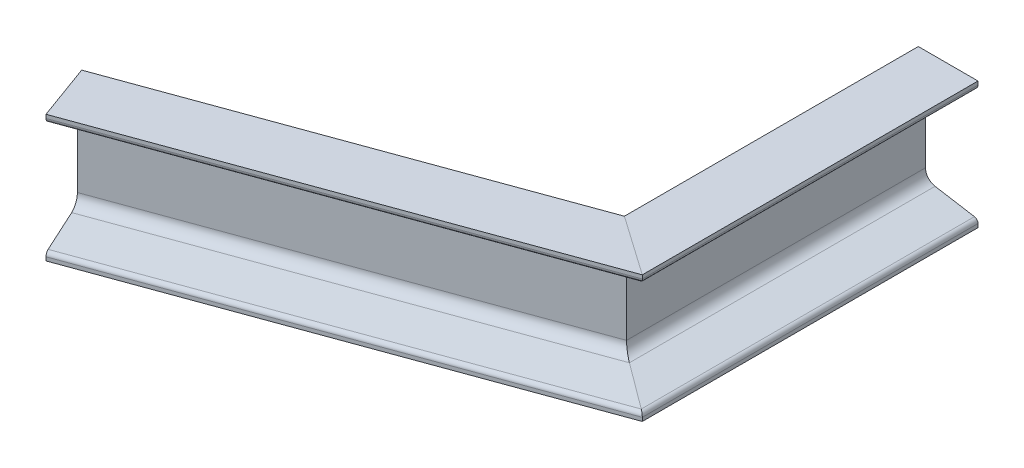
ISO-10303-21;
HEADER;
FILE_DESCRIPTION(('STEP AP214'),'2;1');
FILE_NAME('part.step','',(''),(''),'','','');
FILE_SCHEMA(('AUTOMOTIVE_DESIGN { 1 0 10303 214 1 1 1 1 }'));
ENDSEC;
DATA;
#1=APPLICATION_CONTEXT('core data for automotive mechanical design processes');
#2=APPLICATION_PROTOCOL_DEFINITION('international standard','automotive_design',2000,#1);
#3=PRODUCT_CONTEXT('',#1,'mechanical');
#4=PRODUCT('Part','Part','',(#3));
#5=PRODUCT_RELATED_PRODUCT_CATEGORY('part','',(#4));
#6=PRODUCT_DEFINITION_FORMATION('','',#4);
#7=PRODUCT_DEFINITION_CONTEXT('part definition',#1,'design');
#8=PRODUCT_DEFINITION('design','',#6,#7);
#9=PRODUCT_DEFINITION_SHAPE('','',#8);
#10=(LENGTH_UNIT() NAMED_UNIT(*) SI_UNIT(.MILLI.,.METRE.));
#11=(NAMED_UNIT(*) PLANE_ANGLE_UNIT() SI_UNIT($,.RADIAN.));
#12=(NAMED_UNIT(*) SI_UNIT($,.STERADIAN.) SOLID_ANGLE_UNIT());
#13=UNCERTAINTY_MEASURE_WITH_UNIT(LENGTH_MEASURE(1.E-05),#10,'distance_accuracy_value','');
#14=(GEOMETRIC_REPRESENTATION_CONTEXT(3) GLOBAL_UNCERTAINTY_ASSIGNED_CONTEXT((#13)) GLOBAL_UNIT_ASSIGNED_CONTEXT((#10,
#11,#12)) REPRESENTATION_CONTEXT('',''));
#15=CARTESIAN_POINT('',(0.,0.,0.));
#16=DIRECTION('',(0.,0.,1.));
#17=DIRECTION('',(1.,0.,0.));
#18=AXIS2_PLACEMENT_3D('',#15,#16,#17);
#19=CARTESIAN_POINT('',(33.274,2.157664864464,0.));
#20=DIRECTION('',(0.,0.,1.));
#21=DIRECTION('',(1.,0.,0.));
#22=AXIS2_PLACEMENT_3D('',#19,#20,#21);
#23=PLANE('',#22);
#24=DIRECTION('',(1.,0.,0.));
#25=VECTOR('',#24,1.);
#26=CARTESIAN_POINT('',(0.,0.,0.));
#27=LINE('',#26,#25);
#28=CARTESIAN_POINT('',(0.,0.,0.));
#29=VERTEX_POINT('',#28);
#30=CARTESIAN_POINT('',(35.814,0.,0.));
#31=VERTEX_POINT('',#30);
#32=EDGE_CURVE('E141',#29,#31,#27,.T.);
#33=ORIENTED_EDGE('',*,*,#32,.F.);
#34=DIRECTION('',(0.,-1.,0.));
#35=VECTOR('',#34,1.);
#36=CARTESIAN_POINT('',(0.,0.,0.));
#37=LINE('',#36,#35);
#38=CARTESIAN_POINT('',(0.,76.2,0.));
#39=VERTEX_POINT('',#38);
#40=EDGE_CURVE('E177',#39,#29,#37,.T.);
#41=ORIENTED_EDGE('',*,*,#40,.F.);
#42=DIRECTION('',(-1.,0.,0.));
#43=VECTOR('',#42,1.);
#44=CARTESIAN_POINT('',(0.,76.2,0.));
#45=LINE('',#44,#43);
#46=CARTESIAN_POINT('',(35.814,76.2,0.));
#47=VERTEX_POINT('',#46);
#48=EDGE_CURVE('E174',#47,#39,#45,.T.);
#49=ORIENTED_EDGE('',*,*,#48,.F.);
#50=DIRECTION('',(0.,1.,0.));
#51=VECTOR('',#50,1.);
#52=CARTESIAN_POINT('',(35.814,76.2,0.));
#53=LINE('',#52,#51);
#54=CARTESIAN_POINT('',(35.814,74.042335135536,0.));
#55=VERTEX_POINT('',#54);
#56=EDGE_CURVE('E171',#55,#47,#53,.T.);
#57=ORIENTED_EDGE('',*,*,#56,.F.);
#58=CARTESIAN_POINT('',(33.274,74.042335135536,0.));
#59=DIRECTION('',(0.,0.,1.));
#60=DIRECTION('',(-1.,0.,0.));
#61=AXIS2_PLACEMENT_3D('',#58,#59,#60);
#62=CIRCLE('',#61,2.54);
#63=CARTESIAN_POINT('',(33.6916030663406,71.5368995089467,0.));
#64=VERTEX_POINT('',#63);
#65=EDGE_CURVE('E168',#64,#55,#62,.T.);
#66=ORIENTED_EDGE('',*,*,#65,.F.);
#67=DIRECTION('',(0.986391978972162,0.164410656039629,0.));
#68=VECTOR('',#67,1.);
#69=CARTESIAN_POINT('',(10.0484717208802,67.5960901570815,0.));
#70=LINE('',#69,#68);
#71=CARTESIAN_POINT('',(10.0484717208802,67.5960901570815,0.));
#72=VERTEX_POINT('',#71);
#73=EDGE_CURVE('E165',#72,#64,#70,.T.);
#74=ORIENTED_EDGE('',*,*,#73,.F.);
#75=CARTESIAN_POINT('',(11.176,60.8314139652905,0.));
#76=DIRECTION('',(0.,0.,-1.));
#77=DIRECTION('',(-1.,0.,0.));
#78=AXIS2_PLACEMENT_3D('',#75,#76,#77);
#79=CIRCLE('',#78,6.858);
#80=CARTESIAN_POINT('',(4.318,60.8314139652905,0.));
#81=VERTEX_POINT('',#80);
#82=EDGE_CURVE('E162',#81,#72,#79,.T.);
#83=ORIENTED_EDGE('',*,*,#82,.F.);
#84=DIRECTION('',(0.,1.,0.));
#85=VECTOR('',#84,1.);
#86=CARTESIAN_POINT('',(4.318,60.8314139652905,0.));
#87=LINE('',#86,#85);
#88=CARTESIAN_POINT('',(4.318,15.3685860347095,0.));
#89=VERTEX_POINT('',#88);
#90=EDGE_CURVE('E159',#89,#81,#87,.T.);
#91=ORIENTED_EDGE('',*,*,#90,.F.);
#92=CARTESIAN_POINT('',(11.176,15.3685860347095,0.));
#93=DIRECTION('',(0.,0.,-1.));
#94=DIRECTION('',(1.,0.,0.));
#95=AXIS2_PLACEMENT_3D('',#92,#93,#94);
#96=CIRCLE('',#95,6.858);
#97=CARTESIAN_POINT('',(10.0484717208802,8.60390984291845,0.));
#98=VERTEX_POINT('',#97);
#99=EDGE_CURVE('E156',#98,#89,#96,.T.);
#100=ORIENTED_EDGE('',*,*,#99,.F.);
#101=DIRECTION('',(-0.986391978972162,0.16441065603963,0.));
#102=VECTOR('',#101,1.);
#103=CARTESIAN_POINT('',(10.0484717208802,8.60390984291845,0.));
#104=LINE('',#103,#102);
#105=CARTESIAN_POINT('',(33.6916030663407,4.66310049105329,0.));
#106=VERTEX_POINT('',#105);
#107=EDGE_CURVE('E153',#106,#98,#104,.T.);
#108=ORIENTED_EDGE('',*,*,#107,.F.);
#109=CARTESIAN_POINT('',(33.274,2.157664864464,0.));
#110=DIRECTION('',(0.,0.,1.));
#111=DIRECTION('',(1.,0.,0.));
#112=AXIS2_PLACEMENT_3D('',#109,#110,#111);
#113=CIRCLE('',#112,2.54);
#114=CARTESIAN_POINT('',(35.814,2.157664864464,0.));
#115=VERTEX_POINT('',#114);
#116=EDGE_CURVE('E144',#115,#106,#113,.T.);
#117=ORIENTED_EDGE('',*,*,#116,.F.);
#118=DIRECTION('',(0.,1.,0.));
#119=VECTOR('',#118,1.);
#120=CARTESIAN_POINT('',(35.814,0.,0.));
#121=LINE('',#120,#119);
#122=EDGE_CURVE('E133',#31,#115,#121,.T.);
#123=ORIENTED_EDGE('',*,*,#122,.F.);
#124=EDGE_LOOP('',(#33,#41,#49,#57,#66,#74,#83,#91,#100,#108,#117,#123));
#125=FACE_BOUND('',#124,.T.);
#126=ADVANCED_FACE('F38',(#125),#23,.F.);
#127=CARTESIAN_POINT('',(0.,0.,282.32541166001));
#128=DIRECTION('',(1.,0.,0.));
#129=DIRECTION('',(0.,1.,0.));
#130=AXIS2_PLACEMENT_3D('',#127,#128,#129);
#131=PLANE('',#130);
#132=DIRECTION('',(0.,0.,-1.));
#133=VECTOR('',#132,1.);
#134=CARTESIAN_POINT('',(0.,0.,282.32541166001));
#135=LINE('',#134,#133);
#136=CARTESIAN_POINT('',(0.,0.,176.29586054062));
#137=VERTEX_POINT('',#136);
#138=EDGE_CURVE('E147',#137,#29,#135,.T.);
#139=ORIENTED_EDGE('',*,*,#138,.F.);
#140=DIRECTION('',(0.,1.,0.));
#141=VECTOR('',#140,1.);
#142=CARTESIAN_POINT('',(0.,0.,176.29586054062));
#143=LINE('',#142,#141);
#144=CARTESIAN_POINT('',(0.,76.2,176.29586054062));
#145=VERTEX_POINT('',#144);
#146=EDGE_CURVE('E42',#137,#145,#143,.T.);
#147=ORIENTED_EDGE('',*,*,#146,.T.);
#148=DIRECTION('',(0.,0.,-1.));
#149=VECTOR('',#148,1.);
#150=CARTESIAN_POINT('',(0.,76.2,282.32541166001));
#151=LINE('',#150,#149);
#152=EDGE_CURVE('E180',#145,#39,#151,.T.);
#153=ORIENTED_EDGE('',*,*,#152,.T.);
#154=ORIENTED_EDGE('',*,*,#40,.T.);
#155=EDGE_LOOP('',(#139,#147,#153,#154));
#156=FACE_BOUND('',#155,.T.);
#157=ADVANCED_FACE('F227',(#156),#131,.F.);
#158=CARTESIAN_POINT('',(0.,76.2,282.32541166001));
#159=DIRECTION('',(0.,-1.,0.));
#160=DIRECTION('',(0.,0.,-1.));
#161=AXIS2_PLACEMENT_3D('',#158,#159,#160);
#162=PLANE('',#161);
#163=ORIENTED_EDGE('',*,*,#152,.F.);
#164=DIRECTION('',(0.819152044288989,0.,0.57357643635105));
#165=VECTOR('',#164,1.);
#166=CARTESIAN_POINT('',(49.8175933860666,76.2,211.17851496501));
#167=LINE('',#166,#165);
#168=CARTESIAN_POINT('',(35.814,76.2,201.373093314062));
#169=VERTEX_POINT('',#168);
#170=EDGE_CURVE('E221',#145,#169,#167,.T.);
#171=ORIENTED_EDGE('',*,*,#170,.T.);
#172=DIRECTION('',(0.,0.,-1.));
#173=VECTOR('',#172,1.);
#174=CARTESIAN_POINT('',(35.814,76.2,282.32541166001));
#175=LINE('',#174,#173);
#176=EDGE_CURVE('E182',#169,#47,#175,.T.);
#177=ORIENTED_EDGE('',*,*,#176,.T.);
#178=ORIENTED_EDGE('',*,*,#48,.T.);
#179=EDGE_LOOP('',(#163,#171,#177,#178));
#180=FACE_BOUND('',#179,.T.);
#181=ADVANCED_FACE('F229',(#180),#162,.F.);
#182=CARTESIAN_POINT('',(35.814,76.2,282.32541166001));
#183=DIRECTION('',(-1.,0.,0.));
#184=DIRECTION('',(0.,0.,1.));
#185=AXIS2_PLACEMENT_3D('',#182,#183,#184);
#186=PLANE('',#185);
#187=ORIENTED_EDGE('',*,*,#176,.F.);
#188=DIRECTION('',(0.,-1.,0.));
#189=VECTOR('',#188,1.);
#190=CARTESIAN_POINT('',(35.814,76.2,201.373093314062));
#191=LINE('',#190,#189);
#192=CARTESIAN_POINT('',(35.814,74.042335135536,201.373093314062));
#193=VERTEX_POINT('',#192);
#194=EDGE_CURVE('E57',#169,#193,#191,.T.);
#195=ORIENTED_EDGE('',*,*,#194,.T.);
#196=DIRECTION('',(0.,0.,-1.));
#197=VECTOR('',#196,1.);
#198=CARTESIAN_POINT('',(35.814,74.042335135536,282.32541166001));
#199=LINE('',#198,#197);
#200=EDGE_CURVE('E184',#193,#55,#199,.T.);
#201=ORIENTED_EDGE('',*,*,#200,.T.);
#202=ORIENTED_EDGE('',*,*,#56,.T.);
#203=EDGE_LOOP('',(#187,#195,#201,#202));
#204=FACE_BOUND('',#203,.T.);
#205=ADVANCED_FACE('F235',(#204),#186,.F.);
#206=CARTESIAN_POINT('',(33.274,74.042335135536,282.32541166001));
#207=DIRECTION('',(0.,0.,-1.));
#208=DIRECTION('',(-1.,0.,0.));
#209=AXIS2_PLACEMENT_3D('',#206,#207,#208);
#210=CYLINDRICAL_SURFACE('',#209,2.54);
#211=ORIENTED_EDGE('',*,*,#200,.F.);
#212=CARTESIAN_POINT('',(33.274,74.042335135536,199.59456616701));
#213=DIRECTION('',(0.57357643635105,0.,-0.819152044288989));
#214=DIRECTION('',(-0.819152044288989,0.,-0.57357643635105));
#215=AXIS2_PLACEMENT_3D('',#212,#213,#214);
#216=ELLIPSE('',#215,3.10076745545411,2.54);
#217=CARTESIAN_POINT('',(33.6916030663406,71.5368995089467,199.886974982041));
#218=VERTEX_POINT('',#217);
#219=EDGE_CURVE('E217',#193,#218,#216,.T.);
#220=ORIENTED_EDGE('',*,*,#219,.T.);
#221=DIRECTION('',(0.,0.,-1.));
#222=VECTOR('',#221,1.);
#223=CARTESIAN_POINT('',(33.6916030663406,71.5368995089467,282.32541166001));
#224=LINE('',#223,#222);
#225=EDGE_CURVE('E186',#218,#64,#224,.T.);
#226=ORIENTED_EDGE('',*,*,#225,.T.);
#227=ORIENTED_EDGE('',*,*,#65,.T.);
#228=EDGE_LOOP('',(#211,#220,#226,#227));
#229=FACE_BOUND('',#228,.T.);
#230=ADVANCED_FACE('F238',(#229),#210,.T.);
#231=CARTESIAN_POINT('',(10.0484717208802,67.5960901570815,282.32541166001));
#232=DIRECTION('',(-0.164410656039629,0.986391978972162,0.));
#233=DIRECTION('',(-0.986391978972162,-0.164410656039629,0.));
#234=AXIS2_PLACEMENT_3D('',#231,#232,#233);
#235=PLANE('',#234);
#236=ORIENTED_EDGE('',*,*,#225,.F.);
#237=DIRECTION('',(-0.811621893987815,-0.135280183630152,-0.568303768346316));
#238=VECTOR('',#237,1.);
#239=CARTESIAN_POINT('',(55.7090202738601,75.206736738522,215.303736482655));
#240=LINE('',#239,#238);
#241=CARTESIAN_POINT('',(10.0484717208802,67.5960901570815,183.331876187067));
#242=VERTEX_POINT('',#241);
#243=EDGE_CURVE('E214',#218,#242,#240,.T.);
#244=ORIENTED_EDGE('',*,*,#243,.T.);
#245=DIRECTION('',(0.,0.,-1.));
#246=VECTOR('',#245,1.);
#247=CARTESIAN_POINT('',(10.0484717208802,67.5960901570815,282.32541166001));
#248=LINE('',#247,#246);
#249=EDGE_CURVE('E188',#242,#72,#248,.T.);
#250=ORIENTED_EDGE('',*,*,#249,.T.);
#251=ORIENTED_EDGE('',*,*,#73,.T.);
#252=EDGE_LOOP('',(#236,#244,#250,#251));
#253=FACE_BOUND('',#252,.T.);
#254=ADVANCED_FACE('F241',(#253),#235,.F.);
#255=CARTESIAN_POINT('',(11.176,60.8314139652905,282.32541166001));
#256=DIRECTION('',(0.,0.,-1.));
#257=DIRECTION('',(-1.,0.,0.));
#258=AXIS2_PLACEMENT_3D('',#255,#256,#257);
#259=CYLINDRICAL_SURFACE('',#258,6.858);
#260=ORIENTED_EDGE('',*,*,#249,.F.);
#261=CARTESIAN_POINT('',(11.176,60.8314139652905,184.121379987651));
#262=DIRECTION('',(0.57357643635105,0.,-0.819152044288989));
#263=DIRECTION('',(-0.819152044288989,0.,-0.57357643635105));
#264=AXIS2_PLACEMENT_3D('',#261,#262,#263);
#265=ELLIPSE('',#264,8.37207212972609,6.858);
#266=CARTESIAN_POINT('',(4.318,60.8314139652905,179.319356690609));
#267=VERTEX_POINT('',#266);
#268=EDGE_CURVE('E211',#242,#267,#265,.F.);
#269=ORIENTED_EDGE('',*,*,#268,.T.);
#270=DIRECTION('',(0.,0.,-1.));
#271=VECTOR('',#270,1.);
#272=CARTESIAN_POINT('',(4.318,60.8314139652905,282.32541166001));
#273=LINE('',#272,#271);
#274=EDGE_CURVE('E190',#267,#81,#273,.T.);
#275=ORIENTED_EDGE('',*,*,#274,.T.);
#276=ORIENTED_EDGE('',*,*,#82,.T.);
#277=EDGE_LOOP('',(#260,#269,#275,#276));
#278=FACE_BOUND('',#277,.T.);
#279=ADVANCED_FACE('F247',(#278),#259,.F.);
#280=CARTESIAN_POINT('',(4.318,60.8314139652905,282.32541166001));
#281=DIRECTION('',(-1.,0.,0.));
#282=DIRECTION('',(0.,-1.,0.));
#283=AXIS2_PLACEMENT_3D('',#280,#281,#282);
#284=PLANE('',#283);
#285=ORIENTED_EDGE('',*,*,#274,.F.);
#286=DIRECTION('',(0.,-1.,0.));
#287=VECTOR('',#286,1.);
#288=CARTESIAN_POINT('',(4.318,60.8314139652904,179.319356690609));
#289=LINE('',#288,#287);
#290=CARTESIAN_POINT('',(4.318,15.3685860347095,179.319356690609));
#291=VERTEX_POINT('',#290);
#292=EDGE_CURVE('E208',#267,#291,#289,.T.);
#293=ORIENTED_EDGE('',*,*,#292,.T.);
#294=DIRECTION('',(0.,0.,-1.));
#295=VECTOR('',#294,1.);
#296=CARTESIAN_POINT('',(4.318,15.3685860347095,282.32541166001));
#297=LINE('',#296,#295);
#298=EDGE_CURVE('E192',#291,#89,#297,.T.);
#299=ORIENTED_EDGE('',*,*,#298,.T.);
#300=ORIENTED_EDGE('',*,*,#90,.T.);
#301=EDGE_LOOP('',(#285,#293,#299,#300));
#302=FACE_BOUND('',#301,.T.);
#303=ADVANCED_FACE('F250',(#302),#284,.F.);
#304=CARTESIAN_POINT('',(11.176,15.3685860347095,282.32541166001));
#305=DIRECTION('',(0.,0.,-1.));
#306=DIRECTION('',(-1.,0.,0.));
#307=AXIS2_PLACEMENT_3D('',#304,#305,#306);
#308=CYLINDRICAL_SURFACE('',#307,6.858);
#309=ORIENTED_EDGE('',*,*,#298,.F.);
#310=CARTESIAN_POINT('',(11.176,15.3685860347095,184.121379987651));
#311=DIRECTION('',(0.57357643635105,0.,-0.819152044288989));
#312=DIRECTION('',(-0.819152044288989,0.,-0.57357643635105));
#313=AXIS2_PLACEMENT_3D('',#310,#311,#312);
#314=ELLIPSE('',#313,8.3720721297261,6.858);
#315=CARTESIAN_POINT('',(10.0484717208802,8.60390984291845,183.331876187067));
#316=VERTEX_POINT('',#315);
#317=EDGE_CURVE('E203',#291,#316,#314,.F.);
#318=ORIENTED_EDGE('',*,*,#317,.T.);
#319=DIRECTION('',(0.,0.,-1.));
#320=VECTOR('',#319,1.);
#321=CARTESIAN_POINT('',(10.0484717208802,8.60390984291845,282.32541166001));
#322=LINE('',#321,#320);
#323=EDGE_CURVE('E194',#316,#98,#322,.T.);
#324=ORIENTED_EDGE('',*,*,#323,.T.);
#325=ORIENTED_EDGE('',*,*,#99,.T.);
#326=EDGE_LOOP('',(#309,#318,#324,#325));
#327=FACE_BOUND('',#326,.T.);
#328=ADVANCED_FACE('F253',(#327),#308,.F.);
#329=CARTESIAN_POINT('',(10.0484717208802,8.60390984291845,282.32541166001));
#330=DIRECTION('',(-0.16441065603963,-0.986391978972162,0.));
#331=DIRECTION('',(0.986391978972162,-0.16441065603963,0.));
#332=AXIS2_PLACEMENT_3D('',#329,#330,#331);
#333=PLANE('',#332);
#334=ORIENTED_EDGE('',*,*,#323,.F.);
#335=DIRECTION('',(0.811621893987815,-0.135280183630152,0.568303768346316));
#336=VECTOR('',#335,1.);
#337=CARTESIAN_POINT('',(55.7090202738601,0.993263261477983,215.303736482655));
#338=LINE('',#337,#336);
#339=CARTESIAN_POINT('',(33.6916030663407,4.66310049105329,199.886974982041));
#340=VERTEX_POINT('',#339);
#341=EDGE_CURVE('E201',#316,#340,#338,.T.);
#342=ORIENTED_EDGE('',*,*,#341,.T.);
#343=DIRECTION('',(0.,0.,-1.));
#344=VECTOR('',#343,1.);
#345=CARTESIAN_POINT('',(33.6916030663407,4.66310049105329,282.32541166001));
#346=LINE('',#345,#344);
#347=EDGE_CURVE('E196',#340,#106,#346,.T.);
#348=ORIENTED_EDGE('',*,*,#347,.T.);
#349=ORIENTED_EDGE('',*,*,#107,.T.);
#350=EDGE_LOOP('',(#334,#342,#348,#349));
#351=FACE_BOUND('',#350,.T.);
#352=ADVANCED_FACE('F256',(#351),#333,.F.);
#353=CARTESIAN_POINT('',(33.274,2.157664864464,282.32541166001));
#354=DIRECTION('',(0.,0.,-1.));
#355=DIRECTION('',(-1.,0.,0.));
#356=AXIS2_PLACEMENT_3D('',#353,#354,#355);
#357=CYLINDRICAL_SURFACE('',#356,2.54);
#358=ORIENTED_EDGE('',*,*,#347,.F.);
#359=CARTESIAN_POINT('',(33.274,2.157664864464,199.59456616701));
#360=DIRECTION('',(0.57357643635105,0.,-0.819152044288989));
#361=DIRECTION('',(-0.819152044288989,0.,-0.57357643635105));
#362=AXIS2_PLACEMENT_3D('',#359,#360,#361);
#363=ELLIPSE('',#362,3.10076745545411,2.54);
#364=CARTESIAN_POINT('',(35.814,2.157664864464,201.373093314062));
#365=VERTEX_POINT('',#364);
#366=EDGE_CURVE('E82',#340,#365,#363,.T.);
#367=ORIENTED_EDGE('',*,*,#366,.T.);
#368=DIRECTION('',(0.,0.,-1.));
#369=VECTOR('',#368,1.);
#370=CARTESIAN_POINT('',(35.814,2.157664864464,282.32541166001));
#371=LINE('',#370,#369);
#372=EDGE_CURVE('E137',#365,#115,#371,.T.);
#373=ORIENTED_EDGE('',*,*,#372,.T.);
#374=ORIENTED_EDGE('',*,*,#116,.T.);
#375=EDGE_LOOP('',(#358,#367,#373,#374));
#376=FACE_BOUND('',#375,.T.);
#377=ADVANCED_FACE('F199',(#376),#357,.T.);
#378=CARTESIAN_POINT('',(35.814,0.,282.32541166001));
#379=DIRECTION('',(-1.,0.,0.));
#380=DIRECTION('',(0.,0.,1.));
#381=AXIS2_PLACEMENT_3D('',#378,#379,#380);
#382=PLANE('',#381);
#383=ORIENTED_EDGE('',*,*,#372,.F.);
#384=DIRECTION('',(0.,-1.,0.));
#385=VECTOR('',#384,1.);
#386=CARTESIAN_POINT('',(35.814,0.,201.373093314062));
#387=LINE('',#386,#385);
#388=CARTESIAN_POINT('',(35.814,0.,201.373093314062));
#389=VERTEX_POINT('',#388);
#390=EDGE_CURVE('E48',#365,#389,#387,.T.);
#391=ORIENTED_EDGE('',*,*,#390,.T.);
#392=DIRECTION('',(0.,0.,-1.));
#393=VECTOR('',#392,1.);
#394=CARTESIAN_POINT('',(35.814,0.,282.32541166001));
#395=LINE('',#394,#393);
#396=EDGE_CURVE('E130',#389,#31,#395,.T.);
#397=ORIENTED_EDGE('',*,*,#396,.T.);
#398=ORIENTED_EDGE('',*,*,#122,.T.);
#399=EDGE_LOOP('',(#383,#391,#397,#398));
#400=FACE_BOUND('',#399,.T.);
#401=ADVANCED_FACE('F132',(#400),#382,.F.);
#402=CARTESIAN_POINT('',(0.,0.,282.32541166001));
#403=DIRECTION('',(0.,1.,0.));
#404=DIRECTION('',(0.,0.,1.));
#405=AXIS2_PLACEMENT_3D('',#402,#403,#404);
#406=PLANE('',#405);
#407=ORIENTED_EDGE('',*,*,#396,.F.);
#408=DIRECTION('',(-0.819152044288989,0.,-0.57357643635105));
#409=VECTOR('',#408,1.);
#410=CARTESIAN_POINT('',(49.8175933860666,0.,211.17851496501));
#411=LINE('',#410,#409);
#412=EDGE_CURVE('E12',#389,#137,#411,.T.);
#413=ORIENTED_EDGE('',*,*,#412,.T.);
#414=ORIENTED_EDGE('',*,*,#138,.T.);
#415=ORIENTED_EDGE('',*,*,#32,.T.);
#416=EDGE_LOOP('',(#407,#413,#414,#415));
#417=FACE_BOUND('',#416,.T.);
#418=ADVANCED_FACE('F40',(#417),#406,.F.);
#419=CARTESIAN_POINT('',(-82.8319596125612,0.,118.296298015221));
#420=DIRECTION('',(0.57357643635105,0.,-0.819152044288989));
#421=DIRECTION('',(-0.819152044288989,0.,-0.57357643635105));
#422=AXIS2_PLACEMENT_3D('',#419,#420,#421);
#423=PLANE('',#422);
#424=ORIENTED_EDGE('',*,*,#390,.F.);
#425=ORIENTED_EDGE('',*,*,#366,.F.);
#426=ORIENTED_EDGE('',*,*,#341,.F.);
#427=ORIENTED_EDGE('',*,*,#317,.F.);
#428=ORIENTED_EDGE('',*,*,#292,.F.);
#429=ORIENTED_EDGE('',*,*,#268,.F.);
#430=ORIENTED_EDGE('',*,*,#243,.F.);
#431=ORIENTED_EDGE('',*,*,#219,.F.);
#432=ORIENTED_EDGE('',*,*,#194,.F.);
#433=ORIENTED_EDGE('',*,*,#170,.F.);
#434=ORIENTED_EDGE('',*,*,#146,.F.);
#435=ORIENTED_EDGE('',*,*,#412,.F.);
#436=EDGE_LOOP('',(#424,#425,#426,#427,#428,#429,#430,#431,#432,#433,#434,#435));
#437=FACE_BOUND('',#436,.T.);
#438=ADVANCED_FACE('F228',(#437),#423,.F.);
#439=CLOSED_SHELL('',(#126,#157,#181,#205,#230,#254,#279,#303,#328,#352,#377,#401,#418,#438));
#440=MANIFOLD_SOLID_BREP('B2',#439);
#441=CARTESIAN_POINT('',(-82.8319596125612,0.,118.296298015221));
#442=DIRECTION('',(0.57357643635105,0.,-0.819152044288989));
#443=DIRECTION('',(-0.819152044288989,0.,-0.57357643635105));
#444=AXIS2_PLACEMENT_3D('',#441,#442,#443);
#445=PLANE('',#444);
#446=DIRECTION('',(0.819152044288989,0.,0.57357643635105));
#447=VECTOR('',#446,1.);
#448=CARTESIAN_POINT('',(49.817593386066,0.,211.17851496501));
#449=LINE('',#448,#447);
#450=CARTESIAN_POINT('',(0.,0.,176.29586054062));
#451=VERTEX_POINT('',#450);
#452=CARTESIAN_POINT('',(35.8139999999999,0.,201.373093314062));
#453=VERTEX_POINT('',#452);
#454=EDGE_CURVE('E349',#451,#453,#449,.T.);
#455=ORIENTED_EDGE('',*,*,#454,.F.);
#456=DIRECTION('',(0.,-1.,0.));
#457=VECTOR('',#456,1.);
#458=CARTESIAN_POINT('',(0.,0.,176.29586054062));
#459=LINE('',#458,#457);
#460=CARTESIAN_POINT('',(0.,76.2,176.29586054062));
#461=VERTEX_POINT('',#460);
#462=EDGE_CURVE('E459',#461,#451,#459,.T.);
#463=ORIENTED_EDGE('',*,*,#462,.F.);
#464=DIRECTION('',(-0.819152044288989,0.,-0.57357643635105));
#465=VECTOR('',#464,1.);
#466=CARTESIAN_POINT('',(49.817593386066,76.2,211.17851496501));
#467=LINE('',#466,#465);
#468=CARTESIAN_POINT('',(35.8139999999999,76.2,201.373093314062));
#469=VERTEX_POINT('',#468);
#470=EDGE_CURVE('E463',#469,#461,#467,.T.);
#471=ORIENTED_EDGE('',*,*,#470,.F.);
#472=DIRECTION('',(0.,1.,0.));
#473=VECTOR('',#472,1.);
#474=CARTESIAN_POINT('',(35.8139999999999,76.2,201.373093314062));
#475=LINE('',#474,#473);
#476=CARTESIAN_POINT('',(35.8139999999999,74.042335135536,201.373093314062));
#477=VERTEX_POINT('',#476);
#478=EDGE_CURVE('E467',#477,#469,#475,.T.);
#479=ORIENTED_EDGE('',*,*,#478,.F.);
#480=CARTESIAN_POINT('',(33.2739999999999,74.042335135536,199.59456616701));
#481=DIRECTION('',(0.57357643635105,0.,-0.819152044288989));
#482=DIRECTION('',(-0.819152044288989,0.,-0.57357643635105));
#483=AXIS2_PLACEMENT_3D('',#480,#481,#482);
#484=ELLIPSE('',#483,3.10076745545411,2.54000000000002);
#485=CARTESIAN_POINT('',(33.6916030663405,71.5368995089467,199.886974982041));
#486=VERTEX_POINT('',#485);
#487=EDGE_CURVE('E471',#486,#477,#484,.F.);
#488=ORIENTED_EDGE('',*,*,#487,.F.);
#489=DIRECTION('',(0.811621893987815,0.135280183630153,0.568303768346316));
#490=VECTOR('',#489,1.);
#491=CARTESIAN_POINT('',(55.7090202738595,75.2067367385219,215.303736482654));
#492=LINE('',#491,#490);
#493=CARTESIAN_POINT('',(10.0484717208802,67.5960901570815,183.331876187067));
#494=VERTEX_POINT('',#493);
#495=EDGE_CURVE('E475',#494,#486,#492,.T.);
#496=ORIENTED_EDGE('',*,*,#495,.F.);
#497=CARTESIAN_POINT('',(11.176,60.8314139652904,184.121379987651));
#498=DIRECTION('',(0.57357643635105,0.,-0.819152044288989));
#499=DIRECTION('',(-0.819152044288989,0.,-0.57357643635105));
#500=AXIS2_PLACEMENT_3D('',#497,#498,#499);
#501=ELLIPSE('',#500,8.37207212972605,6.858);
#502=CARTESIAN_POINT('',(4.31800000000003,60.8314139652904,179.319356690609));
#503=VERTEX_POINT('',#502);
#504=EDGE_CURVE('E479',#503,#494,#501,.T.);
#505=ORIENTED_EDGE('',*,*,#504,.F.);
#506=DIRECTION('',(0.,1.,0.));
#507=VECTOR('',#506,1.);
#508=CARTESIAN_POINT('',(4.31800000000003,60.8314139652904,179.319356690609));
#509=LINE('',#508,#507);
#510=CARTESIAN_POINT('',(4.31800000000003,15.3685860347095,179.319356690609));
#511=VERTEX_POINT('',#510);
#512=EDGE_CURVE('E483',#511,#503,#509,.T.);
#513=ORIENTED_EDGE('',*,*,#512,.F.);
#514=CARTESIAN_POINT('',(11.176,15.3685860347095,184.121379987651));
#515=DIRECTION('',(0.57357643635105,0.,-0.819152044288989));
#516=DIRECTION('',(-0.819152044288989,0.,-0.57357643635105));
#517=AXIS2_PLACEMENT_3D('',#514,#515,#516);
#518=ELLIPSE('',#517,8.37207212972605,6.858);
#519=CARTESIAN_POINT('',(10.0484717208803,8.60390984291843,183.331876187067));
#520=VERTEX_POINT('',#519);
#521=EDGE_CURVE('E487',#520,#511,#518,.T.);
#522=ORIENTED_EDGE('',*,*,#521,.F.);
#523=DIRECTION('',(-0.811621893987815,0.135280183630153,-0.568303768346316));
#524=VECTOR('',#523,1.);
#525=CARTESIAN_POINT('',(55.7090202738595,0.993263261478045,215.303736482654));
#526=LINE('',#525,#524);
#527=CARTESIAN_POINT('',(33.6916030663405,4.66310049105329,199.886974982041));
#528=VERTEX_POINT('',#527);
#529=EDGE_CURVE('E396',#528,#520,#526,.T.);
#530=ORIENTED_EDGE('',*,*,#529,.F.);
#531=CARTESIAN_POINT('',(33.2739999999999,2.157664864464,199.59456616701));
#532=DIRECTION('',(0.57357643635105,0.,-0.819152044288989));
#533=DIRECTION('',(-0.819152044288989,0.,-0.57357643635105));
#534=AXIS2_PLACEMENT_3D('',#531,#532,#533);
#535=ELLIPSE('',#534,3.10076745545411,2.54000000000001);
#536=CARTESIAN_POINT('',(35.8139999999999,2.15766486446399,201.373093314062));
#537=VERTEX_POINT('',#536);
#538=EDGE_CURVE('E401',#537,#528,#535,.F.);
#539=ORIENTED_EDGE('',*,*,#538,.F.);
#540=DIRECTION('',(0.,1.,0.));
#541=VECTOR('',#540,1.);
#542=CARTESIAN_POINT('',(35.8139999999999,0.,201.373093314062));
#543=LINE('',#542,#541);
#544=EDGE_CURVE('E440',#453,#537,#543,.T.);
#545=ORIENTED_EDGE('',*,*,#544,.F.);
#546=EDGE_LOOP('',(#455,#463,#471,#479,#488,#496,#505,#513,#522,#530,#539,#545));
#547=FACE_BOUND('',#546,.T.);
#548=ADVANCED_FACE('F341',(#547),#445,.T.);
#549=CARTESIAN_POINT('',(-227.301547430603,2.157664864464,294.436309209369));
#550=DIRECTION('',(-0.939692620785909,0.,0.342020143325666));
#551=DIRECTION('',(0.342020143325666,0.,0.939692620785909));
#552=AXIS2_PLACEMENT_3D('',#549,#550,#551);
#553=PLANE('',#552);
#554=DIRECTION('',(0.342020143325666,0.,0.939692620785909));
#555=VECTOR('',#554,1.);
#556=CARTESIAN_POINT('',(-238.681925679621,0.,263.168976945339));
#557=LINE('',#556,#555);
#558=CARTESIAN_POINT('',(-238.681925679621,0.,263.168976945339));
#559=VERTEX_POINT('',#558);
#560=CARTESIAN_POINT('',(-226.432816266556,0.,296.823128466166));
#561=VERTEX_POINT('',#560);
#562=EDGE_CURVE('E450',#559,#561,#557,.T.);
#563=ORIENTED_EDGE('',*,*,#562,.T.);
#564=DIRECTION('',(0.,1.,0.));
#565=VECTOR('',#564,1.);
#566=CARTESIAN_POINT('',(-226.432816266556,0.,296.823128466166));
#567=LINE('',#566,#565);
#568=CARTESIAN_POINT('',(-226.432816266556,2.15766486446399,296.823128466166));
#569=VERTEX_POINT('',#568);
#570=EDGE_CURVE('E438',#561,#569,#567,.T.);
#571=ORIENTED_EDGE('',*,*,#570,.T.);
#572=CARTESIAN_POINT('',(-227.301547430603,2.157664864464,294.436309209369));
#573=DIRECTION('',(-0.939692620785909,0.,0.342020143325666));
#574=DIRECTION('',(0.342020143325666,0.,0.939692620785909));
#575=AXIS2_PLACEMENT_3D('',#572,#573,#574);
#576=CIRCLE('',#575,2.54000000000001);
#577=CARTESIAN_POINT('',(-227.15871877,4.66310049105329,294.828727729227));
#578=VERTEX_POINT('',#577);
#579=EDGE_CURVE('E442',#569,#578,#576,.T.);
#580=ORIENTED_EDGE('',*,*,#579,.T.);
#581=DIRECTION('',(-0.337365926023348,0.16441065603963,-0.92690526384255));
#582=VECTOR('',#581,1.);
#583=CARTESIAN_POINT('',(-235.245145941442,8.60390984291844,272.611451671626));
#584=LINE('',#583,#582);
#585=CARTESIAN_POINT('',(-235.245145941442,8.60390984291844,272.611451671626));
#586=VERTEX_POINT('',#585);
#587=EDGE_CURVE('E446',#578,#586,#584,.T.);
#588=ORIENTED_EDGE('',*,*,#587,.T.);
#589=CARTESIAN_POINT('',(-234.859508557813,15.3685860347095,273.670981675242));
#590=DIRECTION('',(0.939692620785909,0.,-0.342020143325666));
#591=DIRECTION('',(0.342020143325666,0.,0.939692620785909));
#592=AXIS2_PLACEMENT_3D('',#589,#590,#591);
#593=CIRCLE('',#592,6.858);
#594=CARTESIAN_POINT('',(-237.205082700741,15.3685860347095,267.226569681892));
#595=VERTEX_POINT('',#594);
#596=EDGE_CURVE('E508',#586,#595,#593,.T.);
#597=ORIENTED_EDGE('',*,*,#596,.T.);
#598=DIRECTION('',(0.,1.,0.));
#599=VECTOR('',#598,1.);
#600=CARTESIAN_POINT('',(-237.205082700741,60.8314139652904,267.226569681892));
#601=LINE('',#600,#599);
#602=CARTESIAN_POINT('',(-237.205082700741,60.8314139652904,267.226569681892));
#603=VERTEX_POINT('',#602);
#604=EDGE_CURVE('E513',#595,#603,#601,.T.);
#605=ORIENTED_EDGE('',*,*,#604,.T.);
#606=CARTESIAN_POINT('',(-234.859508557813,60.8314139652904,273.670981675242));
#607=DIRECTION('',(0.939692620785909,0.,-0.342020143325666));
#608=DIRECTION('',(-0.342020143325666,0.,-0.939692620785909));
#609=AXIS2_PLACEMENT_3D('',#606,#607,#608);
#610=CIRCLE('',#609,6.858);
#611=CARTESIAN_POINT('',(-235.245145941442,67.5960901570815,272.611451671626));
#612=VERTEX_POINT('',#611);
#613=EDGE_CURVE('E517',#603,#612,#610,.T.);
#614=ORIENTED_EDGE('',*,*,#613,.T.);
#615=DIRECTION('',(0.337365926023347,0.16441065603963,0.92690526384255));
#616=VECTOR('',#615,1.);
#617=CARTESIAN_POINT('',(-235.245145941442,67.5960901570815,272.611451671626));
#618=LINE('',#617,#616);
#619=CARTESIAN_POINT('',(-227.15871877,71.5368995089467,294.828727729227));
#620=VERTEX_POINT('',#619);
#621=EDGE_CURVE('E520',#612,#620,#618,.T.);
#622=ORIENTED_EDGE('',*,*,#621,.T.);
#623=CARTESIAN_POINT('',(-227.301547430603,74.042335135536,294.436309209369));
#624=DIRECTION('',(-0.939692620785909,0.,0.342020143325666));
#625=DIRECTION('',(-0.342020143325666,0.,-0.939692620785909));
#626=AXIS2_PLACEMENT_3D('',#623,#624,#625);
#627=CIRCLE('',#626,2.54000000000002);
#628=CARTESIAN_POINT('',(-226.432816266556,74.042335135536,296.823128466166));
#629=VERTEX_POINT('',#628);
#630=EDGE_CURVE('E523',#620,#629,#627,.T.);
#631=ORIENTED_EDGE('',*,*,#630,.T.);
#632=DIRECTION('',(0.,1.,0.));
#633=VECTOR('',#632,1.);
#634=CARTESIAN_POINT('',(-226.432816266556,76.2,296.823128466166));
#635=LINE('',#634,#633);
#636=CARTESIAN_POINT('',(-226.432816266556,76.2,296.823128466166));
#637=VERTEX_POINT('',#636);
#638=EDGE_CURVE('E526',#629,#637,#635,.T.);
#639=ORIENTED_EDGE('',*,*,#638,.T.);
#640=DIRECTION('',(-0.342020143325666,0.,-0.939692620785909));
#641=VECTOR('',#640,1.);
#642=CARTESIAN_POINT('',(-238.681925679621,76.2,263.168976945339));
#643=LINE('',#642,#641);
#644=CARTESIAN_POINT('',(-238.681925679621,76.2,263.168976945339));
#645=VERTEX_POINT('',#644);
#646=EDGE_CURVE('E529',#637,#645,#643,.T.);
#647=ORIENTED_EDGE('',*,*,#646,.T.);
#648=DIRECTION('',(0.,-1.,0.));
#649=VECTOR('',#648,1.);
#650=CARTESIAN_POINT('',(-238.681925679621,0.,263.168976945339));
#651=LINE('',#650,#649);
#652=EDGE_CURVE('E456',#645,#559,#651,.T.);
#653=ORIENTED_EDGE('',*,*,#652,.T.);
#654=EDGE_LOOP('',(#563,#571,#580,#588,#597,#605,#614,#622,#631,#639,#647,#653));
#655=FACE_BOUND('',#654,.T.);
#656=ADVANCED_FACE('F448',(#655),#553,.T.);
#657=CARTESIAN_POINT('',(111.884296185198,0.,173.685769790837));
#658=DIRECTION('',(0.342020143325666,0.,0.939692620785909));
#659=DIRECTION('',(0.939692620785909,0.,-0.342020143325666));
#660=AXIS2_PLACEMENT_3D('',#657,#658,#659);
#661=PLANE('',#660);
#662=DIRECTION('',(-0.939692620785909,0.,0.342020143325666));
#663=VECTOR('',#662,1.);
#664=CARTESIAN_POINT('',(111.884296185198,0.,173.685769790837));
#665=LINE('',#664,#663);
#666=EDGE_CURVE('E36',#453,#561,#665,.T.);
#667=ORIENTED_EDGE('',*,*,#666,.F.);
#668=ORIENTED_EDGE('',*,*,#544,.T.);
#669=DIRECTION('',(-0.939692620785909,0.,0.342020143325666));
#670=VECTOR('',#669,1.);
#671=CARTESIAN_POINT('',(111.884296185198,2.15766486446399,173.685769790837));
#672=LINE('',#671,#670);
#673=EDGE_CURVE('E435',#537,#569,#672,.T.);
#674=ORIENTED_EDGE('',*,*,#673,.T.);
#675=ORIENTED_EDGE('',*,*,#570,.F.);
#676=EDGE_LOOP('',(#667,#668,#674,#675));
#677=FACE_BOUND('',#676,.T.);
#678=ADVANCED_FACE('F436',(#677),#661,.T.);
#679=CARTESIAN_POINT('',(111.015565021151,2.157664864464,171.29895053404));
#680=DIRECTION('',(-0.939692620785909,0.,0.342020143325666));
#681=DIRECTION('',(0.342020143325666,0.,0.939692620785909));
#682=AXIS2_PLACEMENT_3D('',#679,#680,#681);
#683=CYLINDRICAL_SURFACE('',#682,2.54000000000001);
#684=ORIENTED_EDGE('',*,*,#673,.F.);
#685=ORIENTED_EDGE('',*,*,#538,.T.);
#686=DIRECTION('',(-0.939692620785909,0.,0.342020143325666));
#687=VECTOR('',#686,1.);
#688=CARTESIAN_POINT('',(111.158393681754,4.66310049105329,171.691369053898));
#689=LINE('',#688,#687);
#690=EDGE_CURVE('E430',#528,#578,#689,.T.);
#691=ORIENTED_EDGE('',*,*,#690,.T.);
#692=ORIENTED_EDGE('',*,*,#579,.F.);
#693=EDGE_LOOP('',(#684,#685,#691,#692));
#694=FACE_BOUND('',#693,.T.);
#695=ADVANCED_FACE('F443',(#694),#683,.T.);
#696=CARTESIAN_POINT('',(103.071966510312,8.60390984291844,149.474092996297));
#697=DIRECTION('',(0.0562317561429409,0.986391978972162,0.15449548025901));
#698=DIRECTION('',(0.,-0.154740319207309,0.98795517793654));
#699=AXIS2_PLACEMENT_3D('',#696,#697,#698);
#700=PLANE('',#699);
#701=ORIENTED_EDGE('',*,*,#690,.F.);
#702=ORIENTED_EDGE('',*,*,#529,.T.);
#703=DIRECTION('',(-0.939692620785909,0.,0.342020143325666));
#704=VECTOR('',#703,1.);
#705=CARTESIAN_POINT('',(103.071966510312,8.60390984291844,149.474092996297));
#706=LINE('',#705,#704);
#707=EDGE_CURVE('E490',#520,#586,#706,.T.);
#708=ORIENTED_EDGE('',*,*,#707,.T.);
#709=ORIENTED_EDGE('',*,*,#587,.F.);
#710=EDGE_LOOP('',(#701,#702,#708,#709));
#711=FACE_BOUND('',#710,.T.);
#712=ADVANCED_FACE('F505',(#711),#700,.T.);
#713=CARTESIAN_POINT('',(103.45760389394,15.3685860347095,150.533622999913));
#714=DIRECTION('',(-0.939692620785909,0.,0.342020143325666));
#715=DIRECTION('',(0.342020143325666,0.,0.939692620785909));
#716=AXIS2_PLACEMENT_3D('',#713,#714,#715);
#717=CYLINDRICAL_SURFACE('',#716,6.858);
#718=ORIENTED_EDGE('',*,*,#707,.F.);
#719=ORIENTED_EDGE('',*,*,#521,.T.);
#720=DIRECTION('',(-0.939692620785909,0.,0.342020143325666));
#721=VECTOR('',#720,1.);
#722=CARTESIAN_POINT('',(101.112029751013,15.3685860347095,144.089211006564));
#723=LINE('',#722,#721);
#724=EDGE_CURVE('E486',#511,#595,#723,.T.);
#725=ORIENTED_EDGE('',*,*,#724,.T.);
#726=ORIENTED_EDGE('',*,*,#596,.F.);
#727=EDGE_LOOP('',(#718,#719,#725,#726));
#728=FACE_BOUND('',#727,.T.);
#729=ADVANCED_FACE('F509',(#728),#717,.F.);
#730=CARTESIAN_POINT('',(101.112029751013,60.8314139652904,144.089211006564));
#731=DIRECTION('',(0.342020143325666,0.,0.939692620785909));
#732=DIRECTION('',(0.939692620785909,0.,-0.342020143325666));
#733=AXIS2_PLACEMENT_3D('',#730,#731,#732);
#734=PLANE('',#733);
#735=ORIENTED_EDGE('',*,*,#724,.F.);
#736=ORIENTED_EDGE('',*,*,#512,.T.);
#737=DIRECTION('',(-0.939692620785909,0.,0.342020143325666));
#738=VECTOR('',#737,1.);
#739=CARTESIAN_POINT('',(101.112029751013,60.8314139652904,144.089211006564));
#740=LINE('',#739,#738);
#741=EDGE_CURVE('E482',#503,#603,#740,.T.);
#742=ORIENTED_EDGE('',*,*,#741,.T.);
#743=ORIENTED_EDGE('',*,*,#604,.F.);
#744=EDGE_LOOP('',(#735,#736,#742,#743));
#745=FACE_BOUND('',#744,.T.);
#746=ADVANCED_FACE('F570',(#745),#734,.T.);
#747=CARTESIAN_POINT('',(103.45760389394,60.8314139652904,150.533622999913));
#748=DIRECTION('',(-0.939692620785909,0.,0.342020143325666));
#749=DIRECTION('',(0.342020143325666,0.,0.939692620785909));
#750=AXIS2_PLACEMENT_3D('',#747,#748,#749);
#751=CYLINDRICAL_SURFACE('',#750,6.858);
#752=ORIENTED_EDGE('',*,*,#741,.F.);
#753=ORIENTED_EDGE('',*,*,#504,.T.);
#754=DIRECTION('',(-0.939692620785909,0.,0.342020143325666));
#755=VECTOR('',#754,1.);
#756=CARTESIAN_POINT('',(103.071966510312,67.5960901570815,149.474092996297));
#757=LINE('',#756,#755);
#758=EDGE_CURVE('E478',#494,#612,#757,.T.);
#759=ORIENTED_EDGE('',*,*,#758,.T.);
#760=ORIENTED_EDGE('',*,*,#613,.F.);
#761=EDGE_LOOP('',(#752,#753,#759,#760));
#762=FACE_BOUND('',#761,.T.);
#763=ADVANCED_FACE('F568',(#762),#751,.F.);
#764=CARTESIAN_POINT('',(103.071966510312,67.5960901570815,149.474092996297));
#765=DIRECTION('',(0.0562317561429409,-0.986391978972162,0.15449548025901));
#766=DIRECTION('',(0.,-0.154740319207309,-0.98795517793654));
#767=AXIS2_PLACEMENT_3D('',#764,#765,#766);
#768=PLANE('',#767);
#769=ORIENTED_EDGE('',*,*,#758,.F.);
#770=ORIENTED_EDGE('',*,*,#495,.T.);
#771=DIRECTION('',(-0.939692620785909,0.,0.342020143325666));
#772=VECTOR('',#771,1.);
#773=CARTESIAN_POINT('',(111.158393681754,71.5368995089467,171.691369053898));
#774=LINE('',#773,#772);
#775=EDGE_CURVE('E474',#486,#620,#774,.T.);
#776=ORIENTED_EDGE('',*,*,#775,.T.);
#777=ORIENTED_EDGE('',*,*,#621,.F.);
#778=EDGE_LOOP('',(#769,#770,#776,#777));
#779=FACE_BOUND('',#778,.T.);
#780=ADVANCED_FACE('F565',(#779),#768,.T.);
#781=CARTESIAN_POINT('',(111.015565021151,74.042335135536,171.29895053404));
#782=DIRECTION('',(-0.939692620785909,0.,0.342020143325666));
#783=DIRECTION('',(0.342020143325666,0.,0.939692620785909));
#784=AXIS2_PLACEMENT_3D('',#781,#782,#783);
#785=CYLINDRICAL_SURFACE('',#784,2.54000000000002);
#786=ORIENTED_EDGE('',*,*,#775,.F.);
#787=ORIENTED_EDGE('',*,*,#487,.T.);
#788=DIRECTION('',(-0.939692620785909,0.,0.342020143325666));
#789=VECTOR('',#788,1.);
#790=CARTESIAN_POINT('',(111.884296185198,74.042335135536,173.685769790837));
#791=LINE('',#790,#789);
#792=EDGE_CURVE('E470',#477,#629,#791,.T.);
#793=ORIENTED_EDGE('',*,*,#792,.T.);
#794=ORIENTED_EDGE('',*,*,#630,.F.);
#795=EDGE_LOOP('',(#786,#787,#793,#794));
#796=FACE_BOUND('',#795,.T.);
#797=ADVANCED_FACE('F560',(#796),#785,.T.);
#798=CARTESIAN_POINT('',(111.884296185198,76.2,173.685769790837));
#799=DIRECTION('',(0.342020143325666,0.,0.939692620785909));
#800=DIRECTION('',(0.939692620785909,0.,-0.342020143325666));
#801=AXIS2_PLACEMENT_3D('',#798,#799,#800);
#802=PLANE('',#801);
#803=ORIENTED_EDGE('',*,*,#792,.F.);
#804=ORIENTED_EDGE('',*,*,#478,.T.);
#805=DIRECTION('',(-0.939692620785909,0.,0.342020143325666));
#806=VECTOR('',#805,1.);
#807=CARTESIAN_POINT('',(111.884296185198,76.2,173.685769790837));
#808=LINE('',#807,#806);
#809=EDGE_CURVE('E466',#469,#637,#808,.T.);
#810=ORIENTED_EDGE('',*,*,#809,.T.);
#811=ORIENTED_EDGE('',*,*,#638,.F.);
#812=EDGE_LOOP('',(#803,#804,#810,#811));
#813=FACE_BOUND('',#812,.T.);
#814=ADVANCED_FACE('F556',(#813),#802,.T.);
#815=CARTESIAN_POINT('',(99.6351867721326,76.2,140.03161827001));
#816=DIRECTION('',(0.,1.,0.));
#817=DIRECTION('',(0.,0.,1.));
#818=AXIS2_PLACEMENT_3D('',#815,#816,#817);
#819=PLANE('',#818);
#820=ORIENTED_EDGE('',*,*,#809,.F.);
#821=ORIENTED_EDGE('',*,*,#470,.T.);
#822=DIRECTION('',(-0.939692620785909,0.,0.342020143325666));
#823=VECTOR('',#822,1.);
#824=CARTESIAN_POINT('',(99.6351867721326,76.2,140.03161827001));
#825=LINE('',#824,#823);
#826=EDGE_CURVE('E462',#461,#645,#825,.T.);
#827=ORIENTED_EDGE('',*,*,#826,.T.);
#828=ORIENTED_EDGE('',*,*,#646,.F.);
#829=EDGE_LOOP('',(#820,#821,#827,#828));
#830=FACE_BOUND('',#829,.T.);
#831=ADVANCED_FACE('F544',(#830),#819,.T.);
#832=CARTESIAN_POINT('',(99.6351867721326,0.,140.03161827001));
#833=DIRECTION('',(-0.342020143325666,0.,-0.939692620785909));
#834=DIRECTION('',(-0.939692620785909,0.,0.342020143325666));
#835=AXIS2_PLACEMENT_3D('',#832,#833,#834);
#836=PLANE('',#835);
#837=ORIENTED_EDGE('',*,*,#826,.F.);
#838=ORIENTED_EDGE('',*,*,#462,.T.);
#839=DIRECTION('',(-0.939692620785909,0.,0.342020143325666));
#840=VECTOR('',#839,1.);
#841=CARTESIAN_POINT('',(99.6351867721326,0.,140.03161827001));
#842=LINE('',#841,#840);
#843=EDGE_CURVE('E458',#451,#559,#842,.T.);
#844=ORIENTED_EDGE('',*,*,#843,.T.);
#845=ORIENTED_EDGE('',*,*,#652,.F.);
#846=EDGE_LOOP('',(#837,#838,#844,#845));
#847=FACE_BOUND('',#846,.T.);
#848=ADVANCED_FACE('F536',(#847),#836,.T.);
#849=CARTESIAN_POINT('',(99.6351867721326,0.,140.03161827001));
#850=DIRECTION('',(0.,-1.,0.));
#851=DIRECTION('',(0.,0.,-1.));
#852=AXIS2_PLACEMENT_3D('',#849,#850,#851);
#853=PLANE('',#852);
#854=ORIENTED_EDGE('',*,*,#843,.F.);
#855=ORIENTED_EDGE('',*,*,#454,.T.);
#856=ORIENTED_EDGE('',*,*,#666,.T.);
#857=ORIENTED_EDGE('',*,*,#562,.F.);
#858=EDGE_LOOP('',(#854,#855,#856,#857));
#859=FACE_BOUND('',#858,.T.);
#860=ADVANCED_FACE('F538',(#859),#853,.T.);
#861=CLOSED_SHELL('',(#548,#656,#678,#695,#712,#729,#746,#763,#780,#797,#814,#831,#848,#860));
#862=MANIFOLD_SOLID_BREP('B6',#861);
#863=ADVANCED_BREP_SHAPE_REPRESENTATION('',(#18,#440,#862),#14);
#864=SHAPE_DEFINITION_REPRESENTATION(#9,#863);
ENDSEC;
END-ISO-10303-21;
